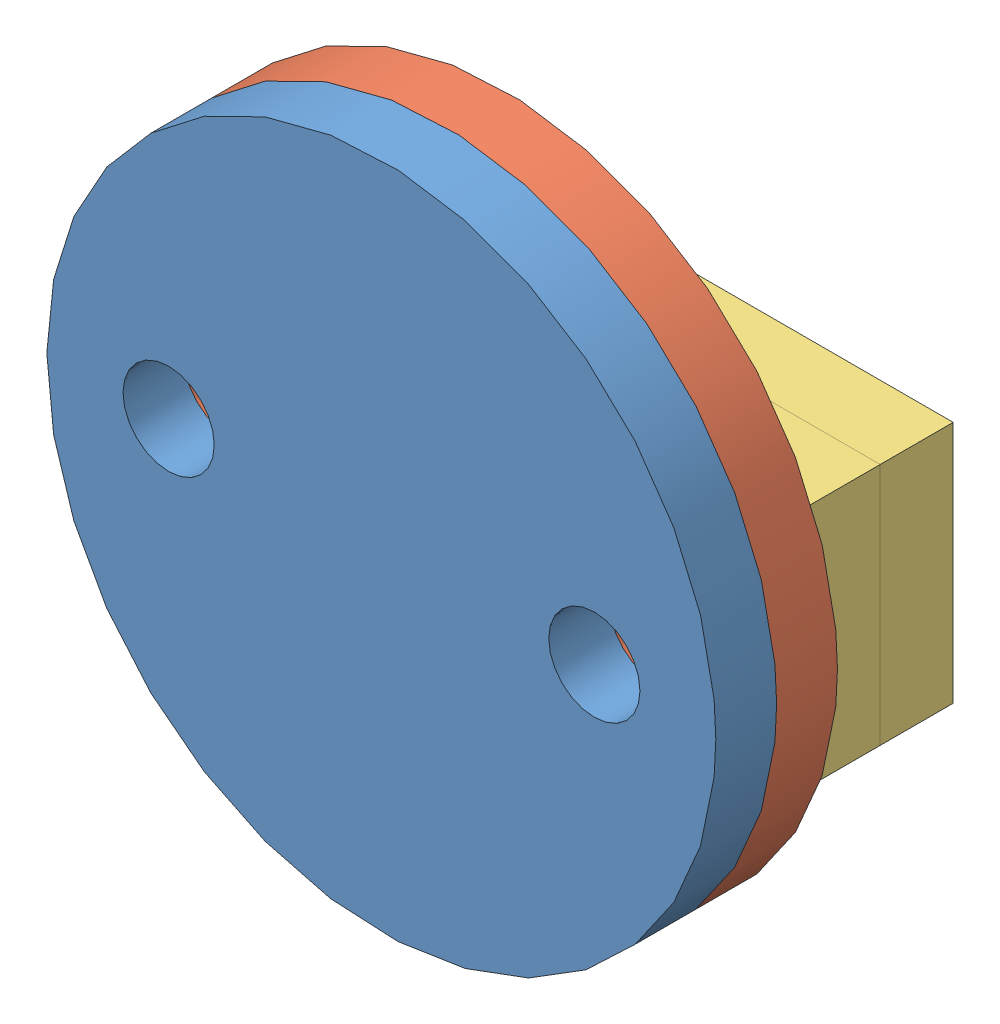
SolidWorks assembly Nose Cone Anchor.SLDASM, configuration Default (file format 3100). Lengths in mm.
Overall size (34.92 34.92 13.97).
4 component instances, 3 part files, 5 mates.
Components (placement in the parent):
- AluminumNoseBulkPlate-1: AluminumNoseBulkPlate.SLDPRT [Default] at (37.2677 -15.1504 -9.3727) size (34.92 34.92 3.17)
- NoseBulkPlateBottom-1: NoseBulkPlateBottom.SLDPRT [Default] at (4.2032 -0.9861 -4.723) size (34.92 34.92 3.17)
- miniSRM-1: miniSRM.SLDPRT [Default] at (8.2595 -3.8516 -4.723) x (1 0 0) z (0 0 -1) size (31.75 12.7 3.81)
- miniSRM-2: miniSRM.SLDPRT [Default] at (8.2595 -3.8516 -8.533) x (1 0 0) z (0 0 -1) size (31.75 12.7 3.81)
Mates (geometry in assembly coordinates):
- Coincident9: coincident anti-aligned: plane of NoseBulkPlateBottom-1 through (4.2032 -0.9861 -4.723) normal (0 0 -1); plane of miniSRM-1 through (-11.6626 5.569 -4.723) normal (0 0 1)
- Coincident10: coincident anti-aligned: plane of AluminumNoseBulkPlate-1 through (4.2032 -0.9861 -1.548) normal (0 0 -1); plane of NoseBulkPlateBottom-1 through (4.2032 -0.9861 -1.548) normal (0 0 1)
- Concentric3: concentric aligned: cylinder of AluminumNoseBulkPlate-1; cylinder of NoseBulkPlateBottom-1
- Coincident11: coincident anti-aligned: plane of miniSRM-1 through (-11.6626 5.569 -8.533) normal (0 0 -1); plane of miniSRM-2 through (-11.6626 5.569 -8.533) normal (0 0 1)
- Concentric4: concentric aligned: cylinder of miniSRM-1; cylinder of miniSRM-2
